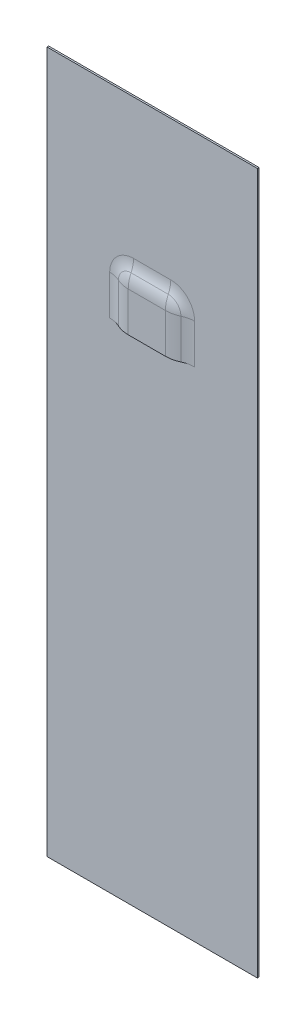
ISO-10303-21;
HEADER;
FILE_DESCRIPTION(('STEP AP214'),'2;1');
FILE_NAME('part.step','',(''),(''),'','','');
FILE_SCHEMA(('AUTOMOTIVE_DESIGN { 1 0 10303 214 1 1 1 1 }'));
ENDSEC;
DATA;
#1=APPLICATION_CONTEXT('core data for automotive mechanical design processes');
#2=APPLICATION_PROTOCOL_DEFINITION('international standard','automotive_design',2000,#1);
#3=PRODUCT_CONTEXT('',#1,'mechanical');
#4=PRODUCT('Part','Part','',(#3));
#5=PRODUCT_RELATED_PRODUCT_CATEGORY('part','',(#4));
#6=PRODUCT_DEFINITION_FORMATION('','',#4);
#7=PRODUCT_DEFINITION_CONTEXT('part definition',#1,'design');
#8=PRODUCT_DEFINITION('design','',#6,#7);
#9=PRODUCT_DEFINITION_SHAPE('','',#8);
#10=(LENGTH_UNIT() NAMED_UNIT(*) SI_UNIT(.MILLI.,.METRE.));
#11=(NAMED_UNIT(*) PLANE_ANGLE_UNIT() SI_UNIT($,.RADIAN.));
#12=(NAMED_UNIT(*) SI_UNIT($,.STERADIAN.) SOLID_ANGLE_UNIT());
#13=UNCERTAINTY_MEASURE_WITH_UNIT(LENGTH_MEASURE(1.E-05),#10,'distance_accuracy_value','');
#14=(GEOMETRIC_REPRESENTATION_CONTEXT(3) GLOBAL_UNCERTAINTY_ASSIGNED_CONTEXT((#13)) GLOBAL_UNIT_ASSIGNED_CONTEXT((#10,
#11,#12)) REPRESENTATION_CONTEXT('',''));
#15=CARTESIAN_POINT('',(0.,0.,0.));
#16=DIRECTION('',(0.,0.,1.));
#17=DIRECTION('',(1.,0.,0.));
#18=AXIS2_PLACEMENT_3D('',#15,#16,#17);
#19=CARTESIAN_POINT('',(0.,0.,0.));
#20=DIRECTION('',(0.,0.,1.));
#21=DIRECTION('',(1.,0.,0.));
#22=AXIS2_PLACEMENT_3D('',#19,#20,#21);
#23=PLANE('',#22);
#24=DIRECTION('',(0.,1.,0.));
#25=VECTOR('',#24,1.);
#26=CARTESIAN_POINT('',(74.9999999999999,250.,0.));
#27=LINE('',#26,#25);
#28=CARTESIAN_POINT('',(75.,-250.,0.));
#29=VERTEX_POINT('',#28);
#30=CARTESIAN_POINT('',(74.9999999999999,250.,0.));
#31=VERTEX_POINT('',#30);
#32=EDGE_CURVE('E331',#29,#31,#27,.T.);
#33=ORIENTED_EDGE('',*,*,#32,.T.);
#34=DIRECTION('',(-1.,0.,0.));
#35=VECTOR('',#34,1.);
#36=CARTESIAN_POINT('',(-75.0000000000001,250.,0.));
#37=LINE('',#36,#35);
#38=CARTESIAN_POINT('',(-75.0000000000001,250.,0.));
#39=VERTEX_POINT('',#38);
#40=EDGE_CURVE('E355',#31,#39,#37,.T.);
#41=ORIENTED_EDGE('',*,*,#40,.T.);
#42=DIRECTION('',(0.,-1.,0.));
#43=VECTOR('',#42,1.);
#44=CARTESIAN_POINT('',(-75.0000000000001,250.,0.));
#45=LINE('',#44,#43);
#46=CARTESIAN_POINT('',(-75.,-250.,0.));
#47=VERTEX_POINT('',#46);
#48=EDGE_CURVE('E358',#39,#47,#45,.T.);
#49=ORIENTED_EDGE('',*,*,#48,.T.);
#50=DIRECTION('',(1.,0.,0.));
#51=VECTOR('',#50,1.);
#52=CARTESIAN_POINT('',(-75.,-250.,0.));
#53=LINE('',#52,#51);
#54=EDGE_CURVE('E343',#47,#29,#53,.T.);
#55=ORIENTED_EDGE('',*,*,#54,.T.);
#56=EDGE_LOOP('',(#33,#41,#49,#55));
#57=FACE_BOUND('',#56,.T.);
#58=DIRECTION('',(0.,1.,0.));
#59=VECTOR('',#58,1.);
#60=CARTESIAN_POINT('',(30.287865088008,145.,0.));
#61=LINE('',#60,#59);
#62=CARTESIAN_POINT('',(30.287865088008,133.271402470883,0.));
#63=VERTEX_POINT('',#62);
#64=CARTESIAN_POINT('',(30.2878650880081,105.,0.));
#65=VERTEX_POINT('',#64);
#66=EDGE_CURVE('E269',#63,#65,#61,.F.);
#67=ORIENTED_EDGE('',*,*,#66,.T.);
#68=DIRECTION('',(1.,0.,0.));
#69=VECTOR('',#68,1.);
#70=CARTESIAN_POINT('',(0.,105.,0.));
#71=LINE('',#70,#69);
#72=CARTESIAN_POINT('',(23.4643762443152,105.,0.));
#73=VERTEX_POINT('',#72);
#74=EDGE_CURVE('E306',#65,#73,#71,.F.);
#75=ORIENTED_EDGE('',*,*,#74,.T.);
#76=DIRECTION('',(-1.,0.,0.));
#77=VECTOR('',#76,1.);
#78=CARTESIAN_POINT('',(0.,105.,0.));
#79=LINE('',#78,#77);
#80=CARTESIAN_POINT('',(-23.4643762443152,105.,0.));
#81=VERTEX_POINT('',#80);
#82=EDGE_CURVE('E12',#73,#81,#79,.T.);
#83=ORIENTED_EDGE('',*,*,#82,.T.);
#84=CARTESIAN_POINT('',(-30.287865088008,105.,0.));
#85=VERTEX_POINT('',#84);
#86=EDGE_CURVE('E62',#81,#85,#71,.F.);
#87=ORIENTED_EDGE('',*,*,#86,.T.);
#88=DIRECTION('',(0.,-1.,0.));
#89=VECTOR('',#88,1.);
#90=CARTESIAN_POINT('',(-30.2878650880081,145.,0.));
#91=LINE('',#90,#89);
#92=CARTESIAN_POINT('',(-30.287865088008,133.271402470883,0.));
#93=VERTEX_POINT('',#92);
#94=EDGE_CURVE('E67',#85,#93,#91,.F.);
#95=ORIENTED_EDGE('',*,*,#94,.T.);
#96=CARTESIAN_POINT('',(-13.2714024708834,133.271402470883,0.));
#97=DIRECTION('',(0.,0.,1.));
#98=DIRECTION('',(1.,0.,0.));
#99=AXIS2_PLACEMENT_3D('',#96,#97,#98);
#100=CIRCLE('',#99,17.0164626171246);
#101=CARTESIAN_POINT('',(-13.2714024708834,150.287865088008,0.));
#102=VERTEX_POINT('',#101);
#103=EDGE_CURVE('E244',#93,#102,#100,.F.);
#104=ORIENTED_EDGE('',*,*,#103,.T.);
#105=DIRECTION('',(-1.,0.,0.));
#106=VECTOR('',#105,1.);
#107=CARTESIAN_POINT('',(-25.,150.287865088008,0.));
#108=LINE('',#107,#106);
#109=CARTESIAN_POINT('',(13.2714024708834,150.287865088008,0.));
#110=VERTEX_POINT('',#109);
#111=EDGE_CURVE('E252',#102,#110,#108,.F.);
#112=ORIENTED_EDGE('',*,*,#111,.T.);
#113=CARTESIAN_POINT('',(13.2714024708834,133.271402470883,0.));
#114=DIRECTION('',(0.,0.,1.));
#115=DIRECTION('',(1.,0.,0.));
#116=AXIS2_PLACEMENT_3D('',#113,#114,#115);
#117=CIRCLE('',#116,17.0164626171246);
#118=EDGE_CURVE('E260',#110,#63,#117,.F.);
#119=ORIENTED_EDGE('',*,*,#118,.T.);
#120=EDGE_LOOP('',(#67,#75,#83,#87,#95,#104,#112,#119));
#121=FACE_BOUND('',#120,.T.);
#122=ADVANCED_FACE('F48',(#57,#121),#23,.T.);
#123=CARTESIAN_POINT('',(0.,0.,-1.2));
#124=DIRECTION('',(0.,0.,1.));
#125=DIRECTION('',(1.,0.,0.));
#126=AXIS2_PLACEMENT_3D('',#123,#124,#125);
#127=PLANE('',#126);
#128=DIRECTION('',(0.,1.,0.));
#129=VECTOR('',#128,1.);
#130=CARTESIAN_POINT('',(74.9999999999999,250.,-1.2));
#131=LINE('',#130,#129);
#132=CARTESIAN_POINT('',(75.,-250.,-1.2));
#133=VERTEX_POINT('',#132);
#134=CARTESIAN_POINT('',(74.9999999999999,250.,-1.2));
#135=VERTEX_POINT('',#134);
#136=EDGE_CURVE('E339',#133,#135,#131,.T.);
#137=ORIENTED_EDGE('',*,*,#136,.F.);
#138=DIRECTION('',(1.,0.,0.));
#139=VECTOR('',#138,1.);
#140=CARTESIAN_POINT('',(-75.,-250.,-1.2));
#141=LINE('',#140,#139);
#142=CARTESIAN_POINT('',(-75.,-250.,-1.2));
#143=VERTEX_POINT('',#142);
#144=EDGE_CURVE('E349',#143,#133,#141,.T.);
#145=ORIENTED_EDGE('',*,*,#144,.F.);
#146=DIRECTION('',(0.,-1.,0.));
#147=VECTOR('',#146,1.);
#148=CARTESIAN_POINT('',(-75.0000000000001,250.,-1.2));
#149=LINE('',#148,#147);
#150=CARTESIAN_POINT('',(-75.0000000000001,250.,-1.2));
#151=VERTEX_POINT('',#150);
#152=EDGE_CURVE('E346',#151,#143,#149,.T.);
#153=ORIENTED_EDGE('',*,*,#152,.F.);
#154=DIRECTION('',(-1.,0.,0.));
#155=VECTOR('',#154,1.);
#156=CARTESIAN_POINT('',(-75.0000000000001,250.,-1.2));
#157=LINE('',#156,#155);
#158=EDGE_CURVE('E342',#135,#151,#157,.T.);
#159=ORIENTED_EDGE('',*,*,#158,.F.);
#160=EDGE_LOOP('',(#137,#145,#153,#159));
#161=FACE_BOUND('',#160,.T.);
#162=DIRECTION('',(1.,0.,0.));
#163=VECTOR('',#162,1.);
#164=CARTESIAN_POINT('',(-25.,105.,-1.2));
#165=LINE('',#164,#163);
#166=CARTESIAN_POINT('',(-30.287865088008,105.,-1.2));
#167=VERTEX_POINT('',#166);
#168=CARTESIAN_POINT('',(30.2878650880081,105.,-1.2));
#169=VERTEX_POINT('',#168);
#170=EDGE_CURVE('E307',#167,#169,#165,.T.);
#171=ORIENTED_EDGE('',*,*,#170,.T.);
#172=DIRECTION('',(0.,-1.,0.));
#173=VECTOR('',#172,1.);
#174=CARTESIAN_POINT('',(30.2878650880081,105.,-1.2));
#175=LINE('',#174,#173);
#176=CARTESIAN_POINT('',(30.287865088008,133.271402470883,-1.2));
#177=VERTEX_POINT('',#176);
#178=EDGE_CURVE('E310',#177,#169,#175,.T.);
#179=ORIENTED_EDGE('',*,*,#178,.F.);
#180=CARTESIAN_POINT('',(13.2714024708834,133.271402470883,-1.2));
#181=DIRECTION('',(0.,0.,1.));
#182=DIRECTION('',(1.,0.,0.));
#183=AXIS2_PLACEMENT_3D('',#180,#181,#182);
#184=CIRCLE('',#183,17.0164626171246);
#185=CARTESIAN_POINT('',(13.2714024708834,150.287865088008,-1.2));
#186=VERTEX_POINT('',#185);
#187=EDGE_CURVE('E313',#186,#177,#184,.F.);
#188=ORIENTED_EDGE('',*,*,#187,.F.);
#189=DIRECTION('',(1.,0.,0.));
#190=VECTOR('',#189,1.);
#191=CARTESIAN_POINT('',(13.2714024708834,150.287865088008,-1.2));
#192=LINE('',#191,#190);
#193=CARTESIAN_POINT('',(-13.2714024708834,150.287865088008,-1.2));
#194=VERTEX_POINT('',#193);
#195=EDGE_CURVE('E316',#194,#186,#192,.T.);
#196=ORIENTED_EDGE('',*,*,#195,.F.);
#197=CARTESIAN_POINT('',(-13.2714024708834,133.271402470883,-1.2));
#198=DIRECTION('',(0.,0.,1.));
#199=DIRECTION('',(1.,0.,0.));
#200=AXIS2_PLACEMENT_3D('',#197,#198,#199);
#201=CIRCLE('',#200,17.0164626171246);
#202=CARTESIAN_POINT('',(-30.287865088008,133.271402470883,-1.2));
#203=VERTEX_POINT('',#202);
#204=EDGE_CURVE('E319',#203,#194,#201,.F.);
#205=ORIENTED_EDGE('',*,*,#204,.F.);
#206=DIRECTION('',(0.,1.,0.));
#207=VECTOR('',#206,1.);
#208=CARTESIAN_POINT('',(-30.287865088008,133.271402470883,-1.2));
#209=LINE('',#208,#207);
#210=EDGE_CURVE('E322',#167,#203,#209,.T.);
#211=ORIENTED_EDGE('',*,*,#210,.F.);
#212=EDGE_LOOP('',(#171,#179,#188,#196,#205,#211));
#213=FACE_BOUND('',#212,.T.);
#214=ADVANCED_FACE('F381',(#161,#213),#127,.F.);
#215=CARTESIAN_POINT('',(74.9999999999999,250.,-1.2));
#216=DIRECTION('',(1.,0.,0.));
#217=DIRECTION('',(0.,1.,0.));
#218=AXIS2_PLACEMENT_3D('',#215,#216,#217);
#219=PLANE('',#218);
#220=ORIENTED_EDGE('',*,*,#32,.F.);
#221=DIRECTION('',(0.,0.,1.));
#222=VECTOR('',#221,1.);
#223=CARTESIAN_POINT('',(75.,-250.,-1.2));
#224=LINE('',#223,#222);
#225=EDGE_CURVE('E56',#133,#29,#224,.T.);
#226=ORIENTED_EDGE('',*,*,#225,.F.);
#227=ORIENTED_EDGE('',*,*,#136,.T.);
#228=DIRECTION('',(0.,0.,1.));
#229=VECTOR('',#228,1.);
#230=CARTESIAN_POINT('',(74.9999999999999,250.,-1.2));
#231=LINE('',#230,#229);
#232=EDGE_CURVE('E352',#135,#31,#231,.T.);
#233=ORIENTED_EDGE('',*,*,#232,.T.);
#234=EDGE_LOOP('',(#220,#226,#227,#233));
#235=FACE_BOUND('',#234,.T.);
#236=ADVANCED_FACE('F50',(#235),#219,.T.);
#237=CARTESIAN_POINT('',(-75.,-250.,-1.2));
#238=DIRECTION('',(0.,-1.,0.));
#239=DIRECTION('',(0.,0.,-1.));
#240=AXIS2_PLACEMENT_3D('',#237,#238,#239);
#241=PLANE('',#240);
#242=ORIENTED_EDGE('',*,*,#54,.F.);
#243=DIRECTION('',(0.,0.,1.));
#244=VECTOR('',#243,1.);
#245=CARTESIAN_POINT('',(-75.,-250.,-1.2));
#246=LINE('',#245,#244);
#247=EDGE_CURVE('E364',#143,#47,#246,.T.);
#248=ORIENTED_EDGE('',*,*,#247,.F.);
#249=ORIENTED_EDGE('',*,*,#144,.T.);
#250=ORIENTED_EDGE('',*,*,#225,.T.);
#251=EDGE_LOOP('',(#242,#248,#249,#250));
#252=FACE_BOUND('',#251,.T.);
#253=ADVANCED_FACE('F378',(#252),#241,.T.);
#254=CARTESIAN_POINT('',(-75.0000000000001,250.,-1.2));
#255=DIRECTION('',(-1.,0.,0.));
#256=DIRECTION('',(0.,-1.,0.));
#257=AXIS2_PLACEMENT_3D('',#254,#255,#256);
#258=PLANE('',#257);
#259=ORIENTED_EDGE('',*,*,#48,.F.);
#260=DIRECTION('',(0.,0.,1.));
#261=VECTOR('',#260,1.);
#262=CARTESIAN_POINT('',(-75.0000000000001,250.,-1.2));
#263=LINE('',#262,#261);
#264=EDGE_CURVE('E366',#151,#39,#263,.T.);
#265=ORIENTED_EDGE('',*,*,#264,.F.);
#266=ORIENTED_EDGE('',*,*,#152,.T.);
#267=ORIENTED_EDGE('',*,*,#247,.T.);
#268=EDGE_LOOP('',(#259,#265,#266,#267));
#269=FACE_BOUND('',#268,.T.);
#270=ADVANCED_FACE('F385',(#269),#258,.T.);
#271=CARTESIAN_POINT('',(-75.0000000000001,250.,-1.2));
#272=DIRECTION('',(0.,1.,0.));
#273=DIRECTION('',(0.,0.,1.));
#274=AXIS2_PLACEMENT_3D('',#271,#272,#273);
#275=PLANE('',#274);
#276=ORIENTED_EDGE('',*,*,#40,.F.);
#277=ORIENTED_EDGE('',*,*,#232,.F.);
#278=ORIENTED_EDGE('',*,*,#158,.T.);
#279=ORIENTED_EDGE('',*,*,#264,.T.);
#280=EDGE_LOOP('',(#276,#277,#278,#279));
#281=FACE_BOUND('',#280,.T.);
#282=ADVANCED_FACE('F373',(#281),#275,.T.);
#283=CARTESIAN_POINT('',(-25.,105.,2.6));
#284=DIRECTION('',(0.,1.,0.));
#285=DIRECTION('',(0.,0.,1.));
#286=AXIS2_PLACEMENT_3D('',#283,#284,#285);
#287=PLANE('',#286);
#288=CARTESIAN_POINT('',(30.2878650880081,105.,18.8));
#289=DIRECTION('',(0.,1.,0.));
#290=DIRECTION('',(0.,0.,1.));
#291=AXIS2_PLACEMENT_3D('',#288,#289,#290);
#292=CIRCLE('',#291,20.);
#293=EDGE_CURVE('E328',#169,#73,#292,.T.);
#294=ORIENTED_EDGE('',*,*,#293,.F.);
#295=ORIENTED_EDGE('',*,*,#170,.F.);
#296=CARTESIAN_POINT('',(-30.287865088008,105.,18.8));
#297=DIRECTION('',(0.,1.,0.));
#298=DIRECTION('',(0.,0.,1.));
#299=AXIS2_PLACEMENT_3D('',#296,#297,#298);
#300=CIRCLE('',#299,20.);
#301=EDGE_CURVE('E325',#81,#167,#300,.T.);
#302=ORIENTED_EDGE('',*,*,#301,.F.);
#303=ORIENTED_EDGE('',*,*,#82,.F.);
#304=EDGE_LOOP('',(#294,#295,#302,#303));
#305=FACE_BOUND('',#304,.T.);
#306=ADVANCED_FACE('F392',(#305),#287,.T.);
#307=CARTESIAN_POINT('',(30.287865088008,145.,18.8));
#308=DIRECTION('',(0.,1.,0.));
#309=DIRECTION('',(-1.,0.,0.));
#310=AXIS2_PLACEMENT_3D('',#307,#308,#309);
#311=CYLINDRICAL_SURFACE('',#310,20.);
#312=CARTESIAN_POINT('',(30.287865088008,133.271402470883,18.8));
#313=DIRECTION('',(0.,-1.,0.));
#314=DIRECTION('',(1.,0.,0.));
#315=AXIS2_PLACEMENT_3D('',#312,#313,#314);
#316=CIRCLE('',#315,20.);
#317=CARTESIAN_POINT('',(21.7796337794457,133.271402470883,0.699999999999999));
#318=VERTEX_POINT('',#317);
#319=EDGE_CURVE('E311',#318,#177,#316,.T.);
#320=ORIENTED_EDGE('',*,*,#319,.T.);
#321=ORIENTED_EDGE('',*,*,#178,.T.);
#322=ORIENTED_EDGE('',*,*,#293,.T.);
#323=CARTESIAN_POINT('',(30.2878650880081,105.,18.8));
#324=DIRECTION('',(0.,1.,0.));
#325=DIRECTION('',(0.,0.,1.));
#326=AXIS2_PLACEMENT_3D('',#323,#324,#325);
#327=CIRCLE('',#326,20.);
#328=CARTESIAN_POINT('',(21.7796337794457,105.,0.699999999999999));
#329=VERTEX_POINT('',#328);
#330=EDGE_CURVE('E237',#73,#329,#327,.T.);
#331=ORIENTED_EDGE('',*,*,#330,.T.);
#332=DIRECTION('',(0.,1.,0.));
#333=VECTOR('',#332,1.);
#334=CARTESIAN_POINT('',(21.7796337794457,145.,0.699999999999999));
#335=LINE('',#334,#333);
#336=EDGE_CURVE('E713',#329,#318,#335,.T.);
#337=ORIENTED_EDGE('',*,*,#336,.T.);
#338=EDGE_LOOP('',(#320,#321,#322,#331,#337));
#339=FACE_BOUND('',#338,.T.);
#340=ADVANCED_FACE('F401',(#339),#311,.T.);
#341=CARTESIAN_POINT('',(13.2714024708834,133.271402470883,18.8));
#342=DIRECTION('',(0.,0.,1.));
#343=DIRECTION('',(1.,0.,0.));
#344=AXIS2_PLACEMENT_3D('',#341,#342,#343);
#345=DEGENERATE_TOROIDAL_SURFACE('',#344,17.0164626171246,20.,.T.);
#346=CARTESIAN_POINT('',(13.2714024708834,150.287865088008,18.8));
#347=DIRECTION('',(1.,0.,0.));
#348=DIRECTION('',(0.,0.,-1.));
#349=AXIS2_PLACEMENT_3D('',#346,#347,#348);
#350=CIRCLE('',#349,20.);
#351=CARTESIAN_POINT('',(13.2714024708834,141.779633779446,0.699999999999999));
#352=VERTEX_POINT('',#351);
#353=EDGE_CURVE('E336',#352,#186,#350,.T.);
#354=ORIENTED_EDGE('',*,*,#353,.T.);
#355=ORIENTED_EDGE('',*,*,#187,.T.);
#356=ORIENTED_EDGE('',*,*,#319,.F.);
#357=CARTESIAN_POINT('',(13.2714024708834,133.271402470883,0.699999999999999));
#358=DIRECTION('',(0.,0.,-1.));
#359=DIRECTION('',(-1.,0.,0.));
#360=AXIS2_PLACEMENT_3D('',#357,#358,#359);
#361=CIRCLE('',#360,8.50823130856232);
#362=EDGE_CURVE('E234',#318,#352,#361,.F.);
#363=ORIENTED_EDGE('',*,*,#362,.T.);
#364=EDGE_LOOP('',(#354,#355,#356,#363));
#365=FACE_BOUND('',#364,.T.);
#366=ADVANCED_FACE('F404',(#365),#345,.T.);
#367=CARTESIAN_POINT('',(-25.,150.287865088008,18.8));
#368=DIRECTION('',(-1.,0.,0.));
#369=DIRECTION('',(0.,0.,1.));
#370=AXIS2_PLACEMENT_3D('',#367,#368,#369);
#371=CYLINDRICAL_SURFACE('',#370,20.);
#372=CARTESIAN_POINT('',(-13.2714024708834,150.287865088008,18.8));
#373=DIRECTION('',(1.,0.,0.));
#374=DIRECTION('',(0.,0.,-1.));
#375=AXIS2_PLACEMENT_3D('',#372,#373,#374);
#376=CIRCLE('',#375,20.);
#377=CARTESIAN_POINT('',(-13.2714024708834,141.779633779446,0.699999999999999));
#378=VERTEX_POINT('',#377);
#379=EDGE_CURVE('E334',#378,#194,#376,.T.);
#380=ORIENTED_EDGE('',*,*,#379,.T.);
#381=ORIENTED_EDGE('',*,*,#195,.T.);
#382=ORIENTED_EDGE('',*,*,#353,.F.);
#383=DIRECTION('',(-1.,0.,0.));
#384=VECTOR('',#383,1.);
#385=CARTESIAN_POINT('',(-25.,141.779633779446,0.699999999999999));
#386=LINE('',#385,#384);
#387=EDGE_CURVE('E225',#352,#378,#386,.T.);
#388=ORIENTED_EDGE('',*,*,#387,.T.);
#389=EDGE_LOOP('',(#380,#381,#382,#388));
#390=FACE_BOUND('',#389,.T.);
#391=ADVANCED_FACE('F408',(#390),#371,.T.);
#392=CARTESIAN_POINT('',(-13.2714024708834,133.271402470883,18.8));
#393=DIRECTION('',(0.,0.,1.));
#394=DIRECTION('',(1.,0.,0.));
#395=AXIS2_PLACEMENT_3D('',#392,#393,#394);
#396=DEGENERATE_TOROIDAL_SURFACE('',#395,17.0164626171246,20.,.T.);
#397=CARTESIAN_POINT('',(-30.287865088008,133.271402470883,18.8));
#398=DIRECTION('',(0.,1.,0.));
#399=DIRECTION('',(-1.,0.,0.));
#400=AXIS2_PLACEMENT_3D('',#397,#398,#399);
#401=CIRCLE('',#400,20.);
#402=CARTESIAN_POINT('',(-21.7796337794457,133.271402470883,0.699999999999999));
#403=VERTEX_POINT('',#402);
#404=EDGE_CURVE('E332',#403,#203,#401,.T.);
#405=ORIENTED_EDGE('',*,*,#404,.T.);
#406=ORIENTED_EDGE('',*,*,#204,.T.);
#407=ORIENTED_EDGE('',*,*,#379,.F.);
#408=CARTESIAN_POINT('',(-13.2714024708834,133.271402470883,0.699999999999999));
#409=DIRECTION('',(0.,0.,-1.));
#410=DIRECTION('',(-1.,0.,0.));
#411=AXIS2_PLACEMENT_3D('',#408,#409,#410);
#412=CIRCLE('',#411,8.50823130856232);
#413=EDGE_CURVE('E224',#378,#403,#412,.F.);
#414=ORIENTED_EDGE('',*,*,#413,.T.);
#415=EDGE_LOOP('',(#405,#406,#407,#414));
#416=FACE_BOUND('',#415,.T.);
#417=ADVANCED_FACE('F412',(#416),#396,.T.);
#418=CARTESIAN_POINT('',(-30.2878650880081,145.,18.8));
#419=DIRECTION('',(0.,-1.,0.));
#420=DIRECTION('',(1.,0.,0.));
#421=AXIS2_PLACEMENT_3D('',#418,#419,#420);
#422=CYLINDRICAL_SURFACE('',#421,20.);
#423=ORIENTED_EDGE('',*,*,#301,.T.);
#424=ORIENTED_EDGE('',*,*,#210,.T.);
#425=ORIENTED_EDGE('',*,*,#404,.F.);
#426=DIRECTION('',(0.,-1.,0.));
#427=VECTOR('',#426,1.);
#428=CARTESIAN_POINT('',(-21.7796337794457,145.,0.699999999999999));
#429=LINE('',#428,#427);
#430=CARTESIAN_POINT('',(-21.7796337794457,105.,0.699999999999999));
#431=VERTEX_POINT('',#430);
#432=EDGE_CURVE('E218',#403,#431,#429,.T.);
#433=ORIENTED_EDGE('',*,*,#432,.T.);
#434=CARTESIAN_POINT('',(-30.287865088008,105.,18.8));
#435=DIRECTION('',(0.,1.,0.));
#436=DIRECTION('',(0.,0.,1.));
#437=AXIS2_PLACEMENT_3D('',#434,#435,#436);
#438=CIRCLE('',#437,20.);
#439=EDGE_CURVE('E239',#431,#81,#438,.T.);
#440=ORIENTED_EDGE('',*,*,#439,.T.);
#441=EDGE_LOOP('',(#423,#424,#425,#433,#440));
#442=FACE_BOUND('',#441,.T.);
#443=ADVANCED_FACE('F416',(#442),#422,.T.);
#444=CARTESIAN_POINT('',(-30.287865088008,105.,18.8));
#445=DIRECTION('',(0.,-1.,0.));
#446=DIRECTION('',(0.,0.,-1.));
#447=AXIS2_PLACEMENT_3D('',#444,#445,#446);
#448=PLANE('',#447);
#449=ORIENTED_EDGE('',*,*,#74,.F.);
#450=CARTESIAN_POINT('',(30.2878650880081,105.,18.8));
#451=DIRECTION('',(0.,1.,0.));
#452=DIRECTION('',(-1.,0.,0.));
#453=AXIS2_PLACEMENT_3D('',#450,#451,#452);
#454=CIRCLE('',#453,18.8);
#455=CARTESIAN_POINT('',(22.2901276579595,105.,1.786));
#456=VERTEX_POINT('',#455);
#457=EDGE_CURVE('E272',#65,#456,#454,.T.);
#458=ORIENTED_EDGE('',*,*,#457,.T.);
#459=CARTESIAN_POINT('',(13.2714024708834,105.,-17.4));
#460=DIRECTION('',(0.,1.,0.));
#461=DIRECTION('',(-1.,0.,0.));
#462=AXIS2_PLACEMENT_3D('',#459,#460,#461);
#463=CIRCLE('',#462,21.2);
#464=CARTESIAN_POINT('',(13.2714024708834,105.,3.8));
#465=VERTEX_POINT('',#464);
#466=EDGE_CURVE('E277',#456,#465,#463,.F.);
#467=ORIENTED_EDGE('',*,*,#466,.T.);
#468=DIRECTION('',(1.,0.,0.));
#469=VECTOR('',#468,1.);
#470=CARTESIAN_POINT('',(0.,105.,3.8));
#471=LINE('',#470,#469);
#472=CARTESIAN_POINT('',(-13.2714024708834,105.,3.8));
#473=VERTEX_POINT('',#472);
#474=EDGE_CURVE('E288',#473,#465,#471,.T.);
#475=ORIENTED_EDGE('',*,*,#474,.F.);
#476=CARTESIAN_POINT('',(-13.2714024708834,105.,-17.4));
#477=DIRECTION('',(0.,-1.,0.));
#478=DIRECTION('',(1.,0.,0.));
#479=AXIS2_PLACEMENT_3D('',#476,#477,#478);
#480=CIRCLE('',#479,21.2);
#481=CARTESIAN_POINT('',(-22.2901276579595,105.,1.786));
#482=VERTEX_POINT('',#481);
#483=EDGE_CURVE('E247',#473,#482,#480,.T.);
#484=ORIENTED_EDGE('',*,*,#483,.T.);
#485=CARTESIAN_POINT('',(-30.287865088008,105.,18.8));
#486=DIRECTION('',(0.,-1.,0.));
#487=DIRECTION('',(1.,0.,0.));
#488=AXIS2_PLACEMENT_3D('',#485,#486,#487);
#489=CIRCLE('',#488,18.8);
#490=EDGE_CURVE('E203',#482,#85,#489,.F.);
#491=ORIENTED_EDGE('',*,*,#490,.T.);
#492=ORIENTED_EDGE('',*,*,#86,.F.);
#493=ORIENTED_EDGE('',*,*,#439,.F.);
#494=CARTESIAN_POINT('',(-13.2714024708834,105.,-17.4));
#495=DIRECTION('',(0.,1.,0.));
#496=DIRECTION('',(0.,0.,1.));
#497=AXIS2_PLACEMENT_3D('',#494,#495,#496);
#498=CIRCLE('',#497,20.);
#499=CARTESIAN_POINT('',(-13.2714024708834,105.,2.59999999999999));
#500=VERTEX_POINT('',#499);
#501=EDGE_CURVE('E231',#500,#431,#498,.F.);
#502=ORIENTED_EDGE('',*,*,#501,.F.);
#503=DIRECTION('',(1.,0.,0.));
#504=VECTOR('',#503,1.);
#505=CARTESIAN_POINT('',(-25.,105.,2.6));
#506=LINE('',#505,#504);
#507=CARTESIAN_POINT('',(13.2714024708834,105.,2.59999999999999));
#508=VERTEX_POINT('',#507);
#509=EDGE_CURVE('E209',#500,#508,#506,.T.);
#510=ORIENTED_EDGE('',*,*,#509,.T.);
#511=CARTESIAN_POINT('',(13.2714024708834,105.,-17.4));
#512=DIRECTION('',(0.,1.,0.));
#513=DIRECTION('',(0.,0.,1.));
#514=AXIS2_PLACEMENT_3D('',#511,#512,#513);
#515=CIRCLE('',#514,20.);
#516=EDGE_CURVE('E709',#329,#508,#515,.F.);
#517=ORIENTED_EDGE('',*,*,#516,.F.);
#518=ORIENTED_EDGE('',*,*,#330,.F.);
#519=EDGE_LOOP('',(#449,#458,#467,#475,#484,#491,#492,#493,#502,#510,#517,#518));
#520=FACE_BOUND('',#519,.T.);
#521=ADVANCED_FACE('F420',(#520),#448,.T.);
#522=CARTESIAN_POINT('',(13.2714024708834,133.271402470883,-17.4));
#523=DIRECTION('',(0.,0.,1.));
#524=DIRECTION('',(1.,0.,0.));
#525=AXIS2_PLACEMENT_3D('',#522,#523,#524);
#526=SPHERICAL_SURFACE('',#525,20.);
#527=CARTESIAN_POINT('',(13.2714024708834,133.271402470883,-17.4));
#528=DIRECTION('',(0.,1.,0.));
#529=DIRECTION('',(-1.,0.,0.));
#530=AXIS2_PLACEMENT_3D('',#527,#528,#529);
#531=CIRCLE('',#530,20.);
#532=CARTESIAN_POINT('',(13.2714024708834,133.271402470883,2.6));
#533=VERTEX_POINT('',#532);
#534=EDGE_CURVE('E722',#318,#533,#531,.F.);
#535=ORIENTED_EDGE('',*,*,#534,.T.);
#536=CARTESIAN_POINT('',(13.2714024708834,133.271402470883,-17.4));
#537=DIRECTION('',(-1.,0.,0.));
#538=DIRECTION('',(0.,0.,1.));
#539=AXIS2_PLACEMENT_3D('',#536,#537,#538);
#540=CIRCLE('',#539,20.);
#541=EDGE_CURVE('E199',#533,#352,#540,.T.);
#542=ORIENTED_EDGE('',*,*,#541,.T.);
#543=ORIENTED_EDGE('',*,*,#362,.F.);
#544=EDGE_LOOP('',(#535,#542,#543));
#545=FACE_BOUND('',#544,.T.);
#546=ADVANCED_FACE('F427',(#545),#526,.F.);
#547=CARTESIAN_POINT('',(-13.2714024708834,133.271402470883,-17.4));
#548=DIRECTION('',(0.,0.,1.));
#549=DIRECTION('',(1.,0.,0.));
#550=AXIS2_PLACEMENT_3D('',#547,#548,#549);
#551=SPHERICAL_SURFACE('',#550,20.);
#552=CARTESIAN_POINT('',(-13.2714024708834,133.271402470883,-17.4));
#553=DIRECTION('',(-1.,0.,0.));
#554=DIRECTION('',(0.,0.,1.));
#555=AXIS2_PLACEMENT_3D('',#552,#553,#554);
#556=CIRCLE('',#555,20.);
#557=CARTESIAN_POINT('',(-13.2714024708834,133.271402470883,2.6));
#558=VERTEX_POINT('',#557);
#559=EDGE_CURVE('E196',#378,#558,#556,.F.);
#560=ORIENTED_EDGE('',*,*,#559,.T.);
#561=CARTESIAN_POINT('',(-13.2714024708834,133.271402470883,-17.4));
#562=DIRECTION('',(0.,-1.,0.));
#563=DIRECTION('',(1.,0.,0.));
#564=AXIS2_PLACEMENT_3D('',#561,#562,#563);
#565=CIRCLE('',#564,20.);
#566=EDGE_CURVE('E216',#558,#403,#565,.T.);
#567=ORIENTED_EDGE('',*,*,#566,.T.);
#568=ORIENTED_EDGE('',*,*,#413,.F.);
#569=EDGE_LOOP('',(#560,#567,#568));
#570=FACE_BOUND('',#569,.T.);
#571=ADVANCED_FACE('F223',(#570),#551,.F.);
#572=CARTESIAN_POINT('',(-13.2714024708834,145.,-17.4));
#573=DIRECTION('',(0.,-1.,0.));
#574=DIRECTION('',(1.,0.,0.));
#575=AXIS2_PLACEMENT_3D('',#572,#573,#574);
#576=CYLINDRICAL_SURFACE('',#575,20.);
#577=ORIENTED_EDGE('',*,*,#566,.F.);
#578=DIRECTION('',(0.,1.,0.));
#579=VECTOR('',#578,1.);
#580=CARTESIAN_POINT('',(-13.2714024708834,105.,2.6));
#581=LINE('',#580,#579);
#582=EDGE_CURVE('E202',#558,#500,#581,.F.);
#583=ORIENTED_EDGE('',*,*,#582,.T.);
#584=ORIENTED_EDGE('',*,*,#501,.T.);
#585=ORIENTED_EDGE('',*,*,#432,.F.);
#586=EDGE_LOOP('',(#577,#583,#584,#585));
#587=FACE_BOUND('',#586,.T.);
#588=ADVANCED_FACE('F217',(#587),#576,.F.);
#589=CARTESIAN_POINT('',(-25.,133.271402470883,-17.4));
#590=DIRECTION('',(-1.,0.,0.));
#591=DIRECTION('',(0.,0.,1.));
#592=AXIS2_PLACEMENT_3D('',#589,#590,#591);
#593=CYLINDRICAL_SURFACE('',#592,20.);
#594=ORIENTED_EDGE('',*,*,#541,.F.);
#595=DIRECTION('',(1.,0.,0.));
#596=VECTOR('',#595,1.);
#597=CARTESIAN_POINT('',(-25.,133.271402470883,2.6));
#598=LINE('',#597,#596);
#599=EDGE_CURVE('E191',#533,#558,#598,.F.);
#600=ORIENTED_EDGE('',*,*,#599,.T.);
#601=ORIENTED_EDGE('',*,*,#559,.F.);
#602=ORIENTED_EDGE('',*,*,#387,.F.);
#603=EDGE_LOOP('',(#594,#600,#601,#602));
#604=FACE_BOUND('',#603,.T.);
#605=ADVANCED_FACE('F193',(#604),#593,.F.);
#606=CARTESIAN_POINT('',(13.2714024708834,145.,-17.4));
#607=DIRECTION('',(0.,1.,0.));
#608=DIRECTION('',(-1.,0.,0.));
#609=AXIS2_PLACEMENT_3D('',#606,#607,#608);
#610=CYLINDRICAL_SURFACE('',#609,20.);
#611=ORIENTED_EDGE('',*,*,#516,.T.);
#612=DIRECTION('',(0.,-1.,0.));
#613=VECTOR('',#612,1.);
#614=CARTESIAN_POINT('',(13.2714024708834,145.,2.6));
#615=LINE('',#614,#613);
#616=EDGE_CURVE('E711',#508,#533,#615,.F.);
#617=ORIENTED_EDGE('',*,*,#616,.T.);
#618=ORIENTED_EDGE('',*,*,#534,.F.);
#619=ORIENTED_EDGE('',*,*,#336,.F.);
#620=EDGE_LOOP('',(#611,#617,#618,#619));
#621=FACE_BOUND('',#620,.T.);
#622=ADVANCED_FACE('F482',(#621),#610,.F.);
#623=CARTESIAN_POINT('',(0.,145.,2.6));
#624=DIRECTION('',(0.,0.,1.));
#625=DIRECTION('',(1.,0.,0.));
#626=AXIS2_PLACEMENT_3D('',#623,#624,#625);
#627=PLANE('',#626);
#628=ORIENTED_EDGE('',*,*,#599,.F.);
#629=ORIENTED_EDGE('',*,*,#616,.F.);
#630=ORIENTED_EDGE('',*,*,#509,.F.);
#631=ORIENTED_EDGE('',*,*,#582,.F.);
#632=EDGE_LOOP('',(#628,#629,#630,#631));
#633=FACE_BOUND('',#632,.T.);
#634=ADVANCED_FACE('F207',(#633),#627,.F.);
#635=CARTESIAN_POINT('',(-30.2878650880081,145.,18.8));
#636=DIRECTION('',(0.,-1.,0.));
#637=DIRECTION('',(1.,0.,0.));
#638=AXIS2_PLACEMENT_3D('',#635,#636,#637);
#639=CYLINDRICAL_SURFACE('',#638,18.8);
#640=CARTESIAN_POINT('',(-30.287865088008,133.271402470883,18.8));
#641=DIRECTION('',(0.,-1.,0.));
#642=DIRECTION('',(1.,0.,0.));
#643=AXIS2_PLACEMENT_3D('',#640,#641,#642);
#644=CIRCLE('',#643,18.8);
#645=CARTESIAN_POINT('',(-22.2901276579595,133.271402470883,1.786));
#646=VERTEX_POINT('',#645);
#647=EDGE_CURVE('E242',#646,#93,#644,.F.);
#648=ORIENTED_EDGE('',*,*,#647,.T.);
#649=ORIENTED_EDGE('',*,*,#94,.F.);
#650=ORIENTED_EDGE('',*,*,#490,.F.);
#651=DIRECTION('',(0.,-1.,0.));
#652=VECTOR('',#651,1.);
#653=CARTESIAN_POINT('',(-22.2901276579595,145.,1.786));
#654=LINE('',#653,#652);
#655=EDGE_CURVE('E245',#646,#482,#654,.T.);
#656=ORIENTED_EDGE('',*,*,#655,.F.);
#657=EDGE_LOOP('',(#648,#649,#650,#656));
#658=FACE_BOUND('',#657,.T.);
#659=ADVANCED_FACE('F468',(#658),#639,.F.);
#660=CARTESIAN_POINT('',(-13.2714024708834,133.271402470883,18.8));
#661=DIRECTION('',(0.,0.,1.));
#662=DIRECTION('',(1.,0.,0.));
#663=AXIS2_PLACEMENT_3D('',#660,#661,#662);
#664=DEGENERATE_TOROIDAL_SURFACE('',#663,17.0164626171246,18.8,.T.);
#665=CARTESIAN_POINT('',(-13.2714024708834,150.287865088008,18.8));
#666=DIRECTION('',(1.,0.,0.));
#667=DIRECTION('',(0.,1.,0.));
#668=AXIS2_PLACEMENT_3D('',#665,#666,#667);
#669=CIRCLE('',#668,18.8);
#670=CARTESIAN_POINT('',(-13.2714024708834,142.290127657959,1.786));
#671=VERTEX_POINT('',#670);
#672=EDGE_CURVE('E249',#671,#102,#669,.T.);
#673=ORIENTED_EDGE('',*,*,#672,.T.);
#674=ORIENTED_EDGE('',*,*,#103,.F.);
#675=ORIENTED_EDGE('',*,*,#647,.F.);
#676=CARTESIAN_POINT('',(-13.2714024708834,133.271402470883,1.786));
#677=DIRECTION('',(0.,0.,1.));
#678=DIRECTION('',(1.,0.,0.));
#679=AXIS2_PLACEMENT_3D('',#676,#677,#678);
#680=CIRCLE('',#679,9.01872518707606);
#681=EDGE_CURVE('E253',#671,#646,#680,.T.);
#682=ORIENTED_EDGE('',*,*,#681,.F.);
#683=EDGE_LOOP('',(#673,#674,#675,#682));
#684=FACE_BOUND('',#683,.T.);
#685=ADVANCED_FACE('F464',(#684),#664,.F.);
#686=CARTESIAN_POINT('',(-25.,150.287865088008,18.8));
#687=DIRECTION('',(-1.,0.,0.));
#688=DIRECTION('',(0.,0.,1.));
#689=AXIS2_PLACEMENT_3D('',#686,#687,#688);
#690=CYLINDRICAL_SURFACE('',#689,18.8);
#691=CARTESIAN_POINT('',(13.2714024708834,150.287865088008,18.8));
#692=DIRECTION('',(-1.,0.,0.));
#693=DIRECTION('',(0.,0.,1.));
#694=AXIS2_PLACEMENT_3D('',#691,#692,#693);
#695=CIRCLE('',#694,18.8);
#696=CARTESIAN_POINT('',(13.2714024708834,142.290127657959,1.786));
#697=VERTEX_POINT('',#696);
#698=EDGE_CURVE('E257',#697,#110,#695,.F.);
#699=ORIENTED_EDGE('',*,*,#698,.T.);
#700=ORIENTED_EDGE('',*,*,#111,.F.);
#701=ORIENTED_EDGE('',*,*,#672,.F.);
#702=DIRECTION('',(-1.,0.,0.));
#703=VECTOR('',#702,1.);
#704=CARTESIAN_POINT('',(-25.,142.290127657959,1.786));
#705=LINE('',#704,#703);
#706=EDGE_CURVE('E261',#697,#671,#705,.T.);
#707=ORIENTED_EDGE('',*,*,#706,.F.);
#708=EDGE_LOOP('',(#699,#700,#701,#707));
#709=FACE_BOUND('',#708,.T.);
#710=ADVANCED_FACE('F460',(#709),#690,.F.);
#711=CARTESIAN_POINT('',(13.2714024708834,133.271402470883,18.8));
#712=DIRECTION('',(0.,0.,1.));
#713=DIRECTION('',(1.,0.,0.));
#714=AXIS2_PLACEMENT_3D('',#711,#712,#713);
#715=DEGENERATE_TOROIDAL_SURFACE('',#714,17.0164626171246,18.8,.T.);
#716=CARTESIAN_POINT('',(30.287865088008,133.271402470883,18.8));
#717=DIRECTION('',(0.,-1.,0.));
#718=DIRECTION('',(0.,0.,-1.));
#719=AXIS2_PLACEMENT_3D('',#716,#717,#718);
#720=CIRCLE('',#719,18.8);
#721=CARTESIAN_POINT('',(22.2901276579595,133.271402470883,1.786));
#722=VERTEX_POINT('',#721);
#723=EDGE_CURVE('E266',#722,#63,#720,.T.);
#724=ORIENTED_EDGE('',*,*,#723,.T.);
#725=ORIENTED_EDGE('',*,*,#118,.F.);
#726=ORIENTED_EDGE('',*,*,#698,.F.);
#727=CARTESIAN_POINT('',(13.2714024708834,133.271402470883,1.786));
#728=DIRECTION('',(0.,0.,1.));
#729=DIRECTION('',(1.,0.,0.));
#730=AXIS2_PLACEMENT_3D('',#727,#728,#729);
#731=CIRCLE('',#730,9.01872518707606);
#732=EDGE_CURVE('E256',#722,#697,#731,.T.);
#733=ORIENTED_EDGE('',*,*,#732,.F.);
#734=EDGE_LOOP('',(#724,#725,#726,#733));
#735=FACE_BOUND('',#734,.T.);
#736=ADVANCED_FACE('F456',(#735),#715,.F.);
#737=CARTESIAN_POINT('',(30.287865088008,145.,18.8));
#738=DIRECTION('',(0.,1.,0.));
#739=DIRECTION('',(-1.,0.,0.));
#740=AXIS2_PLACEMENT_3D('',#737,#738,#739);
#741=CYLINDRICAL_SURFACE('',#740,18.8);
#742=ORIENTED_EDGE('',*,*,#457,.F.);
#743=ORIENTED_EDGE('',*,*,#66,.F.);
#744=ORIENTED_EDGE('',*,*,#723,.F.);
#745=DIRECTION('',(0.,1.,0.));
#746=VECTOR('',#745,1.);
#747=CARTESIAN_POINT('',(22.2901276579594,145.,1.786));
#748=LINE('',#747,#746);
#749=EDGE_CURVE('E273',#456,#722,#748,.T.);
#750=ORIENTED_EDGE('',*,*,#749,.F.);
#751=EDGE_LOOP('',(#742,#743,#744,#750));
#752=FACE_BOUND('',#751,.T.);
#753=ADVANCED_FACE('F452',(#752),#741,.F.);
#754=CARTESIAN_POINT('',(13.2714024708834,133.271402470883,-17.4));
#755=DIRECTION('',(0.,0.,1.));
#756=DIRECTION('',(1.,0.,0.));
#757=AXIS2_PLACEMENT_3D('',#754,#755,#756);
#758=SPHERICAL_SURFACE('',#757,21.2);
#759=CARTESIAN_POINT('',(13.2714024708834,133.271402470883,-17.4));
#760=DIRECTION('',(0.,1.,0.));
#761=DIRECTION('',(-1.,0.,0.));
#762=AXIS2_PLACEMENT_3D('',#759,#760,#761);
#763=CIRCLE('',#762,21.2);
#764=CARTESIAN_POINT('',(13.2714024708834,133.271402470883,3.8));
#765=VERTEX_POINT('',#764);
#766=EDGE_CURVE('E276',#722,#765,#763,.F.);
#767=ORIENTED_EDGE('',*,*,#766,.F.);
#768=ORIENTED_EDGE('',*,*,#732,.T.);
#769=CARTESIAN_POINT('',(13.2714024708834,133.271402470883,-17.4));
#770=DIRECTION('',(-1.,0.,0.));
#771=DIRECTION('',(0.,0.,1.));
#772=AXIS2_PLACEMENT_3D('',#769,#770,#771);
#773=CIRCLE('',#772,21.2);
#774=EDGE_CURVE('E265',#765,#697,#773,.T.);
#775=ORIENTED_EDGE('',*,*,#774,.F.);
#776=EDGE_LOOP('',(#767,#768,#775));
#777=FACE_BOUND('',#776,.T.);
#778=ADVANCED_FACE('F448',(#777),#758,.T.);
#779=CARTESIAN_POINT('',(-13.2714024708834,133.271402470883,-17.4));
#780=DIRECTION('',(0.,0.,1.));
#781=DIRECTION('',(1.,0.,0.));
#782=AXIS2_PLACEMENT_3D('',#779,#780,#781);
#783=SPHERICAL_SURFACE('',#782,21.2);
#784=CARTESIAN_POINT('',(-13.2714024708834,133.271402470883,-17.4));
#785=DIRECTION('',(-1.,0.,0.));
#786=DIRECTION('',(0.,0.,1.));
#787=AXIS2_PLACEMENT_3D('',#784,#785,#786);
#788=CIRCLE('',#787,21.2);
#789=CARTESIAN_POINT('',(-13.2714024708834,133.271402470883,3.8));
#790=VERTEX_POINT('',#789);
#791=EDGE_CURVE('E264',#671,#790,#788,.F.);
#792=ORIENTED_EDGE('',*,*,#791,.F.);
#793=ORIENTED_EDGE('',*,*,#681,.T.);
#794=CARTESIAN_POINT('',(-13.2714024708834,133.271402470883,-17.4));
#795=DIRECTION('',(0.,-1.,0.));
#796=DIRECTION('',(1.,0.,0.));
#797=AXIS2_PLACEMENT_3D('',#794,#795,#796);
#798=CIRCLE('',#797,21.2);
#799=EDGE_CURVE('E248',#790,#646,#798,.T.);
#800=ORIENTED_EDGE('',*,*,#799,.F.);
#801=EDGE_LOOP('',(#792,#793,#800));
#802=FACE_BOUND('',#801,.T.);
#803=ADVANCED_FACE('F444',(#802),#783,.T.);
#804=CARTESIAN_POINT('',(-13.2714024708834,145.,-17.4));
#805=DIRECTION('',(0.,-1.,0.));
#806=DIRECTION('',(1.,0.,0.));
#807=AXIS2_PLACEMENT_3D('',#804,#805,#806);
#808=CYLINDRICAL_SURFACE('',#807,21.2);
#809=ORIENTED_EDGE('',*,*,#799,.T.);
#810=ORIENTED_EDGE('',*,*,#655,.T.);
#811=ORIENTED_EDGE('',*,*,#483,.F.);
#812=DIRECTION('',(0.,1.,0.));
#813=VECTOR('',#812,1.);
#814=CARTESIAN_POINT('',(-13.2714024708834,145.,3.8));
#815=LINE('',#814,#813);
#816=EDGE_CURVE('E285',#790,#473,#815,.F.);
#817=ORIENTED_EDGE('',*,*,#816,.F.);
#818=EDGE_LOOP('',(#809,#810,#811,#817));
#819=FACE_BOUND('',#818,.T.);
#820=ADVANCED_FACE('F440',(#819),#808,.T.);
#821=CARTESIAN_POINT('',(-25.,133.271402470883,-17.4));
#822=DIRECTION('',(-1.,0.,0.));
#823=DIRECTION('',(0.,0.,1.));
#824=AXIS2_PLACEMENT_3D('',#821,#822,#823);
#825=CYLINDRICAL_SURFACE('',#824,21.2);
#826=ORIENTED_EDGE('',*,*,#774,.T.);
#827=ORIENTED_EDGE('',*,*,#706,.T.);
#828=ORIENTED_EDGE('',*,*,#791,.T.);
#829=DIRECTION('',(1.,0.,0.));
#830=VECTOR('',#829,1.);
#831=CARTESIAN_POINT('',(0.,133.271402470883,3.8));
#832=LINE('',#831,#830);
#833=EDGE_CURVE('E283',#765,#790,#832,.F.);
#834=ORIENTED_EDGE('',*,*,#833,.F.);
#835=EDGE_LOOP('',(#826,#827,#828,#834));
#836=FACE_BOUND('',#835,.T.);
#837=ADVANCED_FACE('F436',(#836),#825,.T.);
#838=CARTESIAN_POINT('',(13.2714024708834,145.,-17.4));
#839=DIRECTION('',(0.,1.,0.));
#840=DIRECTION('',(-1.,0.,0.));
#841=AXIS2_PLACEMENT_3D('',#838,#839,#840);
#842=CYLINDRICAL_SURFACE('',#841,21.2);
#843=ORIENTED_EDGE('',*,*,#466,.F.);
#844=ORIENTED_EDGE('',*,*,#749,.T.);
#845=ORIENTED_EDGE('',*,*,#766,.T.);
#846=DIRECTION('',(0.,1.,0.));
#847=VECTOR('',#846,1.);
#848=CARTESIAN_POINT('',(13.2714024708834,145.,3.8));
#849=LINE('',#848,#847);
#850=EDGE_CURVE('E289',#465,#765,#849,.T.);
#851=ORIENTED_EDGE('',*,*,#850,.F.);
#852=EDGE_LOOP('',(#843,#844,#845,#851));
#853=FACE_BOUND('',#852,.T.);
#854=ADVANCED_FACE('F432',(#853),#842,.T.);
#855=CARTESIAN_POINT('',(0.,145.,3.8));
#856=DIRECTION('',(0.,0.,1.));
#857=DIRECTION('',(1.,0.,0.));
#858=AXIS2_PLACEMENT_3D('',#855,#856,#857);
#859=PLANE('',#858);
#860=ORIENTED_EDGE('',*,*,#833,.T.);
#861=ORIENTED_EDGE('',*,*,#816,.T.);
#862=ORIENTED_EDGE('',*,*,#474,.T.);
#863=ORIENTED_EDGE('',*,*,#850,.T.);
#864=EDGE_LOOP('',(#860,#861,#862,#863));
#865=FACE_BOUND('',#864,.T.);
#866=ADVANCED_FACE('F429',(#865),#859,.T.);
#867=CLOSED_SHELL('',(#122,#214,#236,#253,#270,#282,#306,#340,#366,#391,#417,#443,#521,#546,
#571,#588,#605,#622,#634,#659,#685,#710,#736,#753,#778,#803,#820,#837,#854,#866));
#868=MANIFOLD_SOLID_BREP('B2',#867);
#869=ADVANCED_BREP_SHAPE_REPRESENTATION('',(#18,#868),#14);
#870=SHAPE_DEFINITION_REPRESENTATION(#9,#869);
ENDSEC;
END-ISO-10303-21;
